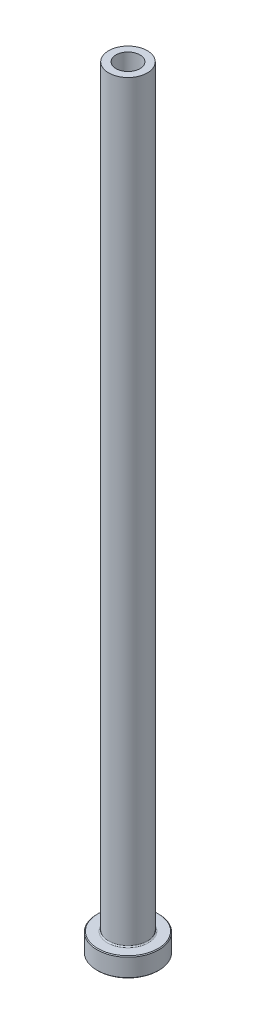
ISO-10303-21;
HEADER;
FILE_DESCRIPTION(('STEP AP214'),'2;1');
FILE_NAME('part.step','',(''),(''),'','','');
FILE_SCHEMA(('AUTOMOTIVE_DESIGN { 1 0 10303 214 1 1 1 1 }'));
ENDSEC;
DATA;
#1=APPLICATION_CONTEXT('core data for automotive mechanical design processes');
#2=APPLICATION_PROTOCOL_DEFINITION('international standard','automotive_design',2000,#1);
#3=PRODUCT_CONTEXT('',#1,'mechanical');
#4=PRODUCT('Part','Part','',(#3));
#5=PRODUCT_RELATED_PRODUCT_CATEGORY('part','',(#4));
#6=PRODUCT_DEFINITION_FORMATION('','',#4);
#7=PRODUCT_DEFINITION_CONTEXT('part definition',#1,'design');
#8=PRODUCT_DEFINITION('design','',#6,#7);
#9=PRODUCT_DEFINITION_SHAPE('','',#8);
#10=(LENGTH_UNIT() NAMED_UNIT(*) SI_UNIT(.MILLI.,.METRE.));
#11=(NAMED_UNIT(*) PLANE_ANGLE_UNIT() SI_UNIT($,.RADIAN.));
#12=(NAMED_UNIT(*) SI_UNIT($,.STERADIAN.) SOLID_ANGLE_UNIT());
#13=UNCERTAINTY_MEASURE_WITH_UNIT(LENGTH_MEASURE(1.E-05),#10,'distance_accuracy_value','');
#14=(GEOMETRIC_REPRESENTATION_CONTEXT(3) GLOBAL_UNCERTAINTY_ASSIGNED_CONTEXT((#13)) GLOBAL_UNIT_ASSIGNED_CONTEXT((#10,
#11,#12)) REPRESENTATION_CONTEXT('',''));
#15=CARTESIAN_POINT('',(0.,0.,0.));
#16=DIRECTION('',(0.,0.,1.));
#17=DIRECTION('',(1.,0.,0.));
#18=AXIS2_PLACEMENT_3D('',#15,#16,#17);
#19=CARTESIAN_POINT('',(0.,92.1876809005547,0.));
#20=DIRECTION('',(0.,1.,0.));
#21=DIRECTION('',(0.,0.,1.));
#22=AXIS2_PLACEMENT_3D('',#19,#20,#21);
#23=CYLINDRICAL_SURFACE('',#22,3.1);
#24=CARTESIAN_POINT('',(0.,200.,0.));
#25=DIRECTION('',(0.,1.,0.));
#26=DIRECTION('',(0.,0.,1.));
#27=AXIS2_PLACEMENT_3D('',#24,#25,#26);
#28=CIRCLE('',#27,3.1);
#29=CARTESIAN_POINT('',(0.,200.,3.1));
#30=VERTEX_POINT('',#29);
#31=EDGE_CURVE('E62',#30,#30,#28,.T.);
#32=ORIENTED_EDGE('',*,*,#31,.T.);
#33=EDGE_LOOP('',(#32));
#34=FACE_BOUND('',#33,.T.);
#35=CARTESIAN_POINT('',(0.,155.,0.));
#36=DIRECTION('',(0.,1.,0.));
#37=DIRECTION('',(0.,0.,1.));
#38=AXIS2_PLACEMENT_3D('',#35,#36,#37);
#39=CIRCLE('',#38,3.1);
#40=CARTESIAN_POINT('',(0.,155.,3.1));
#41=VERTEX_POINT('',#40);
#42=EDGE_CURVE('E71',#41,#41,#39,.T.);
#43=ORIENTED_EDGE('',*,*,#42,.F.);
#44=EDGE_LOOP('',(#43));
#45=FACE_BOUND('',#44,.T.);
#46=ADVANCED_FACE('F30',(#34,#45),#23,.F.);
#47=CARTESIAN_POINT('',(-3.1,200.,0.));
#48=DIRECTION('',(0.,1.,0.));
#49=DIRECTION('',(0.,0.,1.));
#50=AXIS2_PLACEMENT_3D('',#47,#48,#49);
#51=PLANE('',#50);
#52=CARTESIAN_POINT('',(0.,200.,0.));
#53=DIRECTION('',(0.,1.,0.));
#54=DIRECTION('',(0.,0.,1.));
#55=AXIS2_PLACEMENT_3D('',#52,#53,#54);
#56=CIRCLE('',#55,5.00000000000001);
#57=CARTESIAN_POINT('',(0.,200.,5.00000000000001));
#58=VERTEX_POINT('',#57);
#59=EDGE_CURVE('E65',#58,#58,#56,.T.);
#60=ORIENTED_EDGE('',*,*,#59,.T.);
#61=EDGE_LOOP('',(#60));
#62=FACE_BOUND('',#61,.T.);
#63=ORIENTED_EDGE('',*,*,#31,.F.);
#64=EDGE_LOOP('',(#63));
#65=FACE_BOUND('',#64,.T.);
#66=ADVANCED_FACE('F79',(#62,#65),#51,.T.);
#67=CARTESIAN_POINT('',(0.,92.1876809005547,0.));
#68=DIRECTION('',(0.,1.,0.));
#69=DIRECTION('',(0.,0.,1.));
#70=AXIS2_PLACEMENT_3D('',#67,#68,#69);
#71=CYLINDRICAL_SURFACE('',#70,5.);
#72=CARTESIAN_POINT('',(0.,5.3,0.));
#73=DIRECTION('',(0.,1.,0.));
#74=DIRECTION('',(0.,0.,1.));
#75=AXIS2_PLACEMENT_3D('',#72,#73,#74);
#76=CIRCLE('',#75,5.);
#77=CARTESIAN_POINT('',(0.,5.3,5.));
#78=VERTEX_POINT('',#77);
#79=EDGE_CURVE('E59',#78,#78,#76,.T.);
#80=ORIENTED_EDGE('',*,*,#79,.T.);
#81=EDGE_LOOP('',(#80));
#82=FACE_BOUND('',#81,.T.);
#83=ORIENTED_EDGE('',*,*,#59,.F.);
#84=EDGE_LOOP('',(#83));
#85=FACE_BOUND('',#84,.T.);
#86=ADVANCED_FACE('F85',(#82,#85),#71,.T.);
#87=CARTESIAN_POINT('',(-4.99999999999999,5.,0.));
#88=DIRECTION('',(0.,1.,0.));
#89=DIRECTION('',(0.,0.,1.));
#90=AXIS2_PLACEMENT_3D('',#87,#88,#89);
#91=PLANE('',#90);
#92=CARTESIAN_POINT('',(0.,5.,0.));
#93=DIRECTION('',(0.,1.,0.));
#94=DIRECTION('',(0.,0.,1.));
#95=AXIS2_PLACEMENT_3D('',#92,#93,#94);
#96=CIRCLE('',#95,7.79999999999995);
#97=CARTESIAN_POINT('',(0.,5.,7.79999999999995));
#98=VERTEX_POINT('',#97);
#99=EDGE_CURVE('E53',#98,#98,#96,.T.);
#100=ORIENTED_EDGE('',*,*,#99,.T.);
#101=EDGE_LOOP('',(#100));
#102=FACE_BOUND('',#101,.T.);
#103=CARTESIAN_POINT('',(0.,5.,0.));
#104=DIRECTION('',(0.,1.,0.));
#105=DIRECTION('',(0.,0.,1.));
#106=AXIS2_PLACEMENT_3D('',#103,#104,#105);
#107=CIRCLE('',#106,5.3);
#108=CARTESIAN_POINT('',(0.,5.,5.3));
#109=VERTEX_POINT('',#108);
#110=EDGE_CURVE('E56',#109,#109,#107,.F.);
#111=ORIENTED_EDGE('',*,*,#110,.T.);
#112=EDGE_LOOP('',(#111));
#113=FACE_BOUND('',#112,.T.);
#114=ADVANCED_FACE('F111',(#102,#113),#91,.T.);
#115=CARTESIAN_POINT('',(0.,92.1876809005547,0.));
#116=DIRECTION('',(0.,1.,0.));
#117=DIRECTION('',(0.,0.,1.));
#118=AXIS2_PLACEMENT_3D('',#115,#116,#117);
#119=CYLINDRICAL_SURFACE('',#118,7.99999999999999);
#120=CARTESIAN_POINT('',(0.,4.79999999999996,0.));
#121=DIRECTION('',(0.,1.,0.));
#122=DIRECTION('',(0.,0.,1.));
#123=AXIS2_PLACEMENT_3D('',#120,#121,#122);
#124=CIRCLE('',#123,7.99999999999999);
#125=CARTESIAN_POINT('',(0.,4.79999999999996,7.99999999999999));
#126=VERTEX_POINT('',#125);
#127=EDGE_CURVE('E45',#126,#126,#124,.F.);
#128=ORIENTED_EDGE('',*,*,#127,.T.);
#129=EDGE_LOOP('',(#128));
#130=FACE_BOUND('',#129,.T.);
#131=CARTESIAN_POINT('',(0.,0.200000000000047,0.));
#132=DIRECTION('',(0.,-1.,0.));
#133=DIRECTION('',(0.,0.,-1.));
#134=AXIS2_PLACEMENT_3D('',#131,#132,#133);
#135=CIRCLE('',#134,7.99999999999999);
#136=CARTESIAN_POINT('',(0.,0.200000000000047,-7.99999999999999));
#137=VERTEX_POINT('',#136);
#138=EDGE_CURVE('E50',#137,#137,#135,.F.);
#139=ORIENTED_EDGE('',*,*,#138,.T.);
#140=EDGE_LOOP('',(#139));
#141=FACE_BOUND('',#140,.T.);
#142=ADVANCED_FACE('F108',(#130,#141),#119,.T.);
#143=CARTESIAN_POINT('',(-7.99999999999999,0.,0.));
#144=DIRECTION('',(0.,-1.,0.));
#145=DIRECTION('',(0.,0.,-1.));
#146=AXIS2_PLACEMENT_3D('',#143,#144,#145);
#147=PLANE('',#146);
#148=CARTESIAN_POINT('',(0.,0.,0.));
#149=DIRECTION('',(0.,-1.,0.));
#150=DIRECTION('',(0.,0.,-1.));
#151=AXIS2_PLACEMENT_3D('',#148,#149,#150);
#152=CIRCLE('',#151,3.84999999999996);
#153=CARTESIAN_POINT('',(0.,0.,-3.84999999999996));
#154=VERTEX_POINT('',#153);
#155=EDGE_CURVE('E37',#154,#154,#152,.F.);
#156=ORIENTED_EDGE('',*,*,#155,.T.);
#157=EDGE_LOOP('',(#156));
#158=FACE_BOUND('',#157,.T.);
#159=CARTESIAN_POINT('',(0.,0.,0.));
#160=DIRECTION('',(0.,-1.,0.));
#161=DIRECTION('',(0.,0.,-1.));
#162=AXIS2_PLACEMENT_3D('',#159,#160,#161);
#163=CIRCLE('',#162,7.79999999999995);
#164=CARTESIAN_POINT('',(0.,0.,-7.79999999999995));
#165=VERTEX_POINT('',#164);
#166=EDGE_CURVE('E41',#165,#165,#163,.T.);
#167=ORIENTED_EDGE('',*,*,#166,.T.);
#168=EDGE_LOOP('',(#167));
#169=FACE_BOUND('',#168,.T.);
#170=ADVANCED_FACE('F110',(#158,#169),#147,.T.);
#171=CARTESIAN_POINT('',(0.,92.1876809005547,0.));
#172=DIRECTION('',(0.,1.,0.));
#173=DIRECTION('',(0.,0.,1.));
#174=AXIS2_PLACEMENT_3D('',#171,#172,#173);
#175=CYLINDRICAL_SURFACE('',#174,3.35);
#176=CARTESIAN_POINT('',(0.,0.499999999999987,0.));
#177=DIRECTION('',(0.,-1.,0.));
#178=DIRECTION('',(0.,0.,-1.));
#179=AXIS2_PLACEMENT_3D('',#176,#177,#178);
#180=CIRCLE('',#179,3.35);
#181=CARTESIAN_POINT('',(0.,0.499999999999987,-3.35));
#182=VERTEX_POINT('',#181);
#183=EDGE_CURVE('E10',#182,#182,#180,.T.);
#184=ORIENTED_EDGE('',*,*,#183,.T.);
#185=EDGE_LOOP('',(#184));
#186=FACE_BOUND('',#185,.T.);
#187=CARTESIAN_POINT('',(0.,143.,0.));
#188=DIRECTION('',(0.,1.,0.));
#189=DIRECTION('',(0.,0.,1.));
#190=AXIS2_PLACEMENT_3D('',#187,#188,#189);
#191=CIRCLE('',#190,3.35000000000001);
#192=CARTESIAN_POINT('',(0.,143.,3.35000000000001));
#193=VERTEX_POINT('',#192);
#194=EDGE_CURVE('E68',#193,#193,#191,.T.);
#195=ORIENTED_EDGE('',*,*,#194,.T.);
#196=EDGE_LOOP('',(#195));
#197=FACE_BOUND('',#196,.T.);
#198=ADVANCED_FACE('F118',(#186,#197),#175,.F.);
#199=CARTESIAN_POINT('',(0.,143.,0.));
#200=DIRECTION('',(0.,-1.,0.));
#201=DIRECTION('',(0.,0.,-1.));
#202=AXIS2_PLACEMENT_3D('',#199,#200,#201);
#203=CONICAL_SURFACE('',#202,3.35000000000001,0.0208303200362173);
#204=ORIENTED_EDGE('',*,*,#42,.T.);
#205=EDGE_LOOP('',(#204));
#206=FACE_BOUND('',#205,.T.);
#207=ORIENTED_EDGE('',*,*,#194,.F.);
#208=EDGE_LOOP('',(#207));
#209=FACE_BOUND('',#208,.T.);
#210=ADVANCED_FACE('F75',(#206,#209),#203,.F.);
#211=CARTESIAN_POINT('',(0.,5.3,0.));
#212=DIRECTION('',(0.,1.,0.));
#213=DIRECTION('',(0.,0.,1.));
#214=AXIS2_PLACEMENT_3D('',#211,#212,#213);
#215=TOROIDAL_SURFACE('',#214,5.3,0.3);
#216=ORIENTED_EDGE('',*,*,#110,.F.);
#217=EDGE_LOOP('',(#216));
#218=FACE_BOUND('',#217,.T.);
#219=ORIENTED_EDGE('',*,*,#79,.F.);
#220=EDGE_LOOP('',(#219));
#221=FACE_BOUND('',#220,.T.);
#222=ADVANCED_FACE('F90',(#218,#221),#215,.F.);
#223=CARTESIAN_POINT('',(0.,5.,0.));
#224=DIRECTION('',(0.,-1.,0.));
#225=DIRECTION('',(0.,0.,-1.));
#226=AXIS2_PLACEMENT_3D('',#223,#224,#225);
#227=CONICAL_SURFACE('',#226,7.79999999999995,0.78539816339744);
#228=ORIENTED_EDGE('',*,*,#127,.F.);
#229=EDGE_LOOP('',(#228));
#230=FACE_BOUND('',#229,.T.);
#231=ORIENTED_EDGE('',*,*,#99,.F.);
#232=EDGE_LOOP('',(#231));
#233=FACE_BOUND('',#232,.T.);
#234=ADVANCED_FACE('F93',(#230,#233),#227,.T.);
#235=CARTESIAN_POINT('',(0.,0.200000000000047,0.));
#236=DIRECTION('',(0.,1.,0.));
#237=DIRECTION('',(0.,0.,1.));
#238=AXIS2_PLACEMENT_3D('',#235,#236,#237);
#239=CONICAL_SURFACE('',#238,7.99999999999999,0.78539816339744);
#240=ORIENTED_EDGE('',*,*,#166,.F.);
#241=EDGE_LOOP('',(#240));
#242=FACE_BOUND('',#241,.T.);
#243=ORIENTED_EDGE('',*,*,#138,.F.);
#244=EDGE_LOOP('',(#243));
#245=FACE_BOUND('',#244,.T.);
#246=ADVANCED_FACE('F96',(#242,#245),#239,.T.);
#247=CARTESIAN_POINT('',(0.,0.,0.));
#248=DIRECTION('',(0.,-1.,0.));
#249=DIRECTION('',(0.,0.,-1.));
#250=AXIS2_PLACEMENT_3D('',#247,#248,#249);
#251=CONICAL_SURFACE('',#250,3.84999999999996,0.785398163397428);
#252=ORIENTED_EDGE('',*,*,#183,.F.);
#253=EDGE_LOOP('',(#252));
#254=FACE_BOUND('',#253,.T.);
#255=ORIENTED_EDGE('',*,*,#155,.F.);
#256=EDGE_LOOP('',(#255));
#257=FACE_BOUND('',#256,.T.);
#258=ADVANCED_FACE('F32',(#254,#257),#251,.F.);
#259=CLOSED_SHELL('',(#46,#66,#86,#114,#142,#170,#198,#210,#222,#234,#246,#258));
#260=MANIFOLD_SOLID_BREP('B2',#259);
#261=ADVANCED_BREP_SHAPE_REPRESENTATION('',(#18,#260),#14);
#262=SHAPE_DEFINITION_REPRESENTATION(#9,#261);
ENDSEC;
END-ISO-10303-21;
